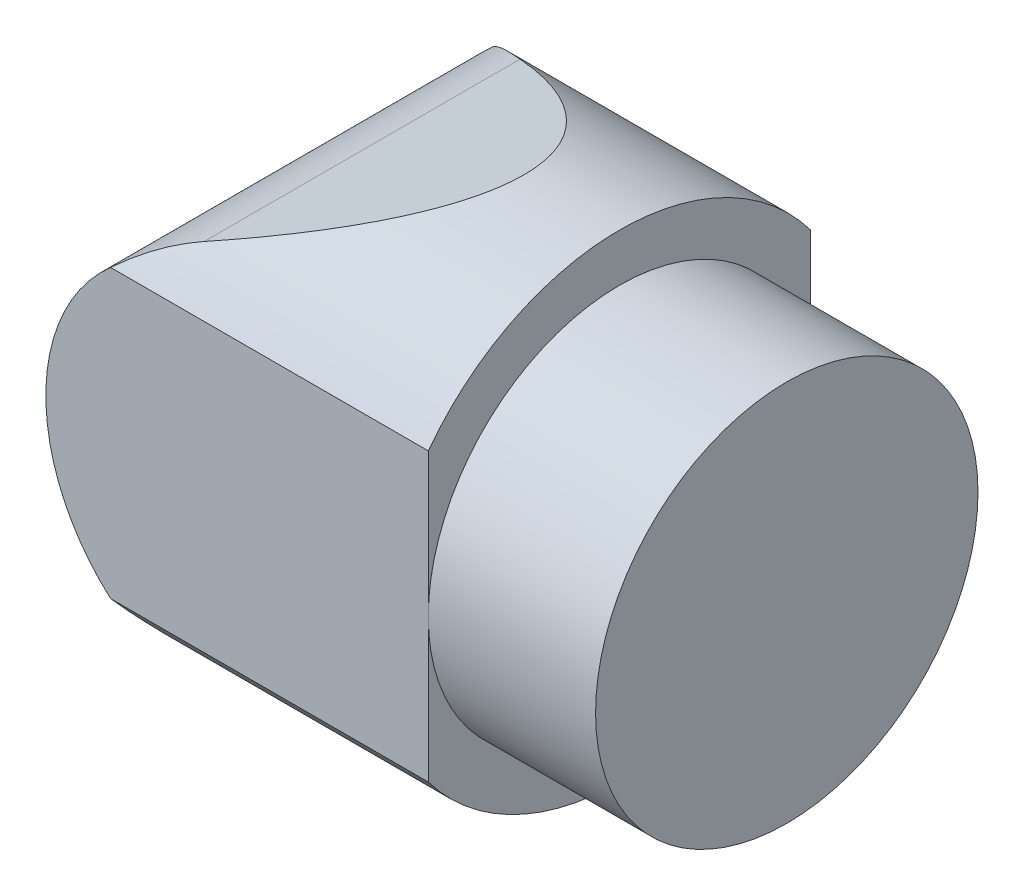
ISO-10303-21;
HEADER;
FILE_DESCRIPTION(('STEP AP214'),'2;1');
FILE_NAME('part.step','',(''),(''),'','','');
FILE_SCHEMA(('AUTOMOTIVE_DESIGN { 1 0 10303 214 1 1 1 1 }'));
ENDSEC;
DATA;
#1=APPLICATION_CONTEXT('core data for automotive mechanical design processes');
#2=APPLICATION_PROTOCOL_DEFINITION('international standard','automotive_design',2000,#1);
#3=PRODUCT_CONTEXT('',#1,'mechanical');
#4=PRODUCT('Part','Part','',(#3));
#5=PRODUCT_RELATED_PRODUCT_CATEGORY('part','',(#4));
#6=PRODUCT_DEFINITION_FORMATION('','',#4);
#7=PRODUCT_DEFINITION_CONTEXT('part definition',#1,'design');
#8=PRODUCT_DEFINITION('design','',#6,#7);
#9=PRODUCT_DEFINITION_SHAPE('','',#8);
#10=(LENGTH_UNIT() NAMED_UNIT(*) SI_UNIT(.MILLI.,.METRE.));
#11=(NAMED_UNIT(*) PLANE_ANGLE_UNIT() SI_UNIT($,.RADIAN.));
#12=(NAMED_UNIT(*) SI_UNIT($,.STERADIAN.) SOLID_ANGLE_UNIT());
#13=UNCERTAINTY_MEASURE_WITH_UNIT(LENGTH_MEASURE(1.E-05),#10,'distance_accuracy_value','');
#14=(GEOMETRIC_REPRESENTATION_CONTEXT(3) GLOBAL_UNCERTAINTY_ASSIGNED_CONTEXT((#13)) GLOBAL_UNIT_ASSIGNED_CONTEXT((#10,
#11,#12)) REPRESENTATION_CONTEXT('',''));
#15=CARTESIAN_POINT('',(0.,0.,0.));
#16=DIRECTION('',(0.,0.,1.));
#17=DIRECTION('',(1.,0.,0.));
#18=AXIS2_PLACEMENT_3D('',#15,#16,#17);
#19=CARTESIAN_POINT('',(0.,0.,-110.141421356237));
#20=DIRECTION('',(1.,0.,0.));
#21=DIRECTION('',(0.,0.,-1.));
#22=AXIS2_PLACEMENT_3D('',#19,#20,#21);
#23=PLANE('',#22);
#24=DIRECTION('',(0.,-1.,0.));
#25=VECTOR('',#24,1.);
#26=CARTESIAN_POINT('',(0.,30.,-40.));
#27=LINE('',#26,#25);
#28=CARTESIAN_POINT('',(0.,30.,-40.));
#29=VERTEX_POINT('',#28);
#30=CARTESIAN_POINT('',(0.,0.,-40.));
#31=VERTEX_POINT('',#30);
#32=EDGE_CURVE('E92',#29,#31,#27,.T.);
#33=ORIENTED_EDGE('',*,*,#32,.F.);
#34=CARTESIAN_POINT('',(0.,0.,0.));
#35=DIRECTION('',(1.,0.,0.));
#36=DIRECTION('',(0.,0.,-1.));
#37=AXIS2_PLACEMENT_3D('',#34,#35,#36);
#38=CIRCLE('',#37,50.);
#39=CARTESIAN_POINT('',(0.,30.,40.));
#40=VERTEX_POINT('',#39);
#41=EDGE_CURVE('E102',#29,#40,#38,.T.);
#42=ORIENTED_EDGE('',*,*,#41,.T.);
#43=DIRECTION('',(0.,1.,0.));
#44=VECTOR('',#43,1.);
#45=CARTESIAN_POINT('',(0.,30.,40.));
#46=LINE('',#45,#44);
#47=CARTESIAN_POINT('',(0.,0.,40.));
#48=VERTEX_POINT('',#47);
#49=EDGE_CURVE('E154',#48,#40,#46,.T.);
#50=ORIENTED_EDGE('',*,*,#49,.F.);
#51=CARTESIAN_POINT('',(0.,0.,0.));
#52=DIRECTION('',(1.,0.,0.));
#53=DIRECTION('',(0.,0.,-1.));
#54=AXIS2_PLACEMENT_3D('',#51,#52,#53);
#55=CIRCLE('',#54,40.);
#56=EDGE_CURVE('E104',#31,#48,#55,.T.);
#57=ORIENTED_EDGE('',*,*,#56,.F.);
#58=EDGE_LOOP('',(#33,#42,#50,#57));
#59=FACE_BOUND('',#58,.T.);
#60=ADVANCED_FACE('F31',(#59),#23,.T.);
#61=CARTESIAN_POINT('',(-100.,0.,0.));
#62=DIRECTION('',(1.,0.,0.));
#63=DIRECTION('',(0.,0.,-1.));
#64=AXIS2_PLACEMENT_3D('',#61,#62,#63);
#65=CYLINDRICAL_SURFACE('',#64,50.);
#66=DIRECTION('',(1.,0.,0.));
#67=VECTOR('',#66,1.);
#68=CARTESIAN_POINT('',(-80.,-30.,-40.));
#69=LINE('',#68,#67);
#70=CARTESIAN_POINT('',(-66.4575131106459,-30.,-40.));
#71=VERTEX_POINT('',#70);
#72=CARTESIAN_POINT('',(0.,-30.,-40.));
#73=VERTEX_POINT('',#72);
#74=EDGE_CURVE('E47',#71,#73,#69,.T.);
#75=ORIENTED_EDGE('',*,*,#74,.T.);
#76=CARTESIAN_POINT('',(0.,-30.,40.));
#77=VERTEX_POINT('',#76);
#78=EDGE_CURVE('E112',#77,#73,#38,.T.);
#79=ORIENTED_EDGE('',*,*,#78,.F.);
#80=DIRECTION('',(1.,0.,0.));
#81=VECTOR('',#80,1.);
#82=CARTESIAN_POINT('',(-80.,-30.,40.));
#83=LINE('',#82,#81);
#84=CARTESIAN_POINT('',(-66.4575131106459,-30.,40.));
#85=VERTEX_POINT('',#84);
#86=EDGE_CURVE('E156',#85,#77,#83,.T.);
#87=ORIENTED_EDGE('',*,*,#86,.F.);
#88=CARTESIAN_POINT('',(-53.8313881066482,-37.5325552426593,33.0349405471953));
#89=CARTESIAN_POINT('',(-54.4122214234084,-37.3184792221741,33.2781937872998));
#90=CARTESIAN_POINT('',(-54.9846616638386,-37.0922393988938,33.5304396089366));
#91=CARTESIAN_POINT('',(-56.1127283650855,-36.6163241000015,34.04949578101));
#92=CARTESIAN_POINT('',(-56.6683600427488,-36.3666559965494,34.3163015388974));
#93=CARTESIAN_POINT('',(-57.7626277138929,-35.8448879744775,34.8609556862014));
#94=CARTESIAN_POINT('',(-58.301279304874,-35.5728095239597,35.1387933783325));
#95=CARTESIAN_POINT('',(-59.3623303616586,-35.0065961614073,35.702913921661));
#96=CARTESIAN_POINT('',(-59.8847283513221,-34.7124592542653,35.9891975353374));
#97=CARTESIAN_POINT('',(-61.4337549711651,-33.7941056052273,36.8601691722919));
#98=CARTESIAN_POINT('',(-62.4360387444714,-33.1369022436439,37.4538421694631));
#99=CARTESIAN_POINT('',(-64.3757445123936,-31.7372601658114,38.6470320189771));
#100=CARTESIAN_POINT('',(-65.3131471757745,-30.9947962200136,39.2465505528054));
#101=CARTESIAN_POINT('',(-67.1187591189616,-29.4278420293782,40.4347194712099));
#102=CARTESIAN_POINT('',(-67.9871454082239,-28.6035746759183,41.0233944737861));
#103=CARTESIAN_POINT('',(-69.6537549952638,-26.8718847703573,42.1780081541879));
#104=CARTESIAN_POINT('',(-70.4519805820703,-25.9644649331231,42.7439475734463));
#105=CARTESIAN_POINT('',(-71.5910002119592,-24.5433508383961,43.5651542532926));
#106=CARTESIAN_POINT('',(-71.9605622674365,-24.0602382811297,43.8339796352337));
#107=CARTESIAN_POINT('',(-72.6797932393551,-23.0738729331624,44.3611197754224));
#108=CARTESIAN_POINT('',(-73.0294634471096,-22.5706214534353,44.61943521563));
#109=CARTESIAN_POINT('',(-73.7077466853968,-21.5445095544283,45.1238387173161));
#110=CARTESIAN_POINT('',(-74.0363679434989,-21.0216569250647,45.3699315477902));
#111=CARTESIAN_POINT('',(-74.6716381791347,-19.9565067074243,45.8484334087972));
#112=CARTESIAN_POINT('',(-74.9782817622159,-19.4142043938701,46.0808390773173));
#113=CARTESIAN_POINT('',(-75.7076082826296,-18.0503399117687,46.6364022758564));
#114=CARTESIAN_POINT('',(-76.1167390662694,-17.2177933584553,46.9506128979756));
#115=CARTESIAN_POINT('',(-76.8803187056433,-15.5149052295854,47.5405001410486));
#116=CARTESIAN_POINT('',(-77.2347806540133,-14.6445727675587,47.816185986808));
#117=CARTESIAN_POINT('',(-77.7222008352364,-13.313858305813,48.1970353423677));
#118=CARTESIAN_POINT('',(-77.8772876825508,-12.8661110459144,48.3185324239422));
#119=CARTESIAN_POINT('',(-78.1722064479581,-11.9627923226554,48.5500670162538));
#120=CARTESIAN_POINT('',(-78.3120409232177,-11.5072221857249,48.660106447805));
#121=CARTESIAN_POINT('',(-78.7079443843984,-10.1295403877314,48.9722212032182));
#122=CARTESIAN_POINT('',(-78.9404509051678,-9.19635533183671,49.1563223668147));
#123=CARTESIAN_POINT('',(-79.3399731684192,-7.30137920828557,49.4734134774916));
#124=CARTESIAN_POINT('',(-79.5065739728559,-6.3394466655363,49.6060794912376));
#125=CARTESIAN_POINT('',(-79.7693132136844,-4.39990670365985,49.8155795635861));
#126=CARTESIAN_POINT('',(-79.8654517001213,-3.42229929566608,49.8924136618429));
#127=CARTESIAN_POINT('',(-79.9854249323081,-1.46006707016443,49.9883277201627));
#128=CARTESIAN_POINT('',(-80.0092772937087,-0.475444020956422,50.007421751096));
#129=CARTESIAN_POINT('',(-79.9842607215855,1.49224086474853,49.9874087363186));
#130=CARTESIAN_POINT('',(-79.9353970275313,2.47530280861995,49.9483058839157));
#131=CARTESIAN_POINT('',(-79.774156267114,4.33616655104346,49.8194887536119));
#132=CARTESIAN_POINT('',(-79.6684049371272,5.2149228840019,49.7350558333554));
#133=CARTESIAN_POINT('',(-79.400033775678,6.95808001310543,49.5212689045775));
#134=CARTESIAN_POINT('',(-79.2374183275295,7.82248191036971,49.3919183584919));
#135=CARTESIAN_POINT('',(-78.8576166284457,9.5316390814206,49.0907424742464));
#136=CARTESIAN_POINT('',(-78.6404284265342,10.3763936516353,48.9189156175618));
#137=CARTESIAN_POINT('',(-78.1542934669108,12.0416947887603,48.535839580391));
#138=CARTESIAN_POINT('',(-77.8853440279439,12.8622400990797,48.3245883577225));
#139=CARTESIAN_POINT('',(-77.2864594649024,14.5093010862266,47.8564907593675));
#140=CARTESIAN_POINT('',(-76.9544348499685,15.3346159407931,47.5981002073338));
#141=CARTESIAN_POINT('',(-76.241200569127,16.9515878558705,47.0465036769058));
#142=CARTESIAN_POINT('',(-75.8599901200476,17.7432443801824,46.7532971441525));
#143=CARTESIAN_POINT('',(-75.0518031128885,19.2907613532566,46.1363277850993));
#144=CARTESIAN_POINT('',(-74.6248102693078,20.0466089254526,45.8125540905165));
#145=CARTESIAN_POINT('',(-73.7283898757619,21.520686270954,45.1388613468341));
#146=CARTESIAN_POINT('',(-73.2589564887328,22.2389108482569,44.7889387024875));
#147=CARTESIAN_POINT('',(-72.4812671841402,23.3499599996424,44.2153230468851));
#148=CARTESIAN_POINT('',(-72.185813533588,23.7554964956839,43.9986786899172));
#149=CARTESIAN_POINT('',(-71.5817837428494,24.5528209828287,43.5587679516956));
#150=CARTESIAN_POINT('',(-71.2732101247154,24.9446115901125,43.3355028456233));
#151=CARTESIAN_POINT('',(-70.3283731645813,26.0994124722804,42.6569775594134));
#152=CARTESIAN_POINT('',(-69.6730041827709,26.8418368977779,42.1929951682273));
#153=CARTESIAN_POINT('',(-68.3144852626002,28.2712383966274,41.2488943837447));
#154=CARTESIAN_POINT('',(-67.611309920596,28.9581855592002,40.7687674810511));
#155=CARTESIAN_POINT('',(-66.1596380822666,30.2759697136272,39.7999289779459));
#156=CARTESIAN_POINT('',(-65.4111380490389,30.906802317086,39.311216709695));
#157=CARTESIAN_POINT('',(-63.8352911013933,32.1391428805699,38.3110096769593));
#158=CARTESIAN_POINT('',(-63.005907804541,32.7380231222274,37.7994869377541));
#159=CARTESIAN_POINT('',(-61.2997344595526,33.872862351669,36.785966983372));
#160=CARTESIAN_POINT('',(-60.422954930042,34.4088352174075,36.2839676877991));
#161=CARTESIAN_POINT('',(-59.0725179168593,35.1639661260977,35.5474227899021));
#162=CARTESIAN_POINT('',(-58.6167175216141,35.4074350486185,35.3047607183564));
#163=CARTESIAN_POINT('',(-57.6930537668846,35.8779106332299,34.826541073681));
#164=CARTESIAN_POINT('',(-57.2251911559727,36.104918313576,34.5909830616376));
#165=CARTESIAN_POINT('',(-56.276908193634,36.5422381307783,34.1286695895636));
#166=CARTESIAN_POINT('',(-55.796478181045,36.7525368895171,33.9019212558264));
#167=CARTESIAN_POINT('',(-54.8232258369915,37.1557422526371,33.4595386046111));
#168=CARTESIAN_POINT('',(-54.3304008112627,37.3486450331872,33.2439067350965));
#169=CARTESIAN_POINT('',(-53.8313881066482,37.5325552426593,33.0349405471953));
#170=B_SPLINE_CURVE_WITH_KNOTS('',3,(#88,#89,#90,#91,#92,#93,#94,#95,#96,#97,#98,#99,#100,#101,
#102,#103,#104,#105,#106,#107,#108,#109,#110,#111,#112,#113,#114,#115,#116,#117,#118,#119,#120,
#121,#122,#123,#124,#125,#126,#127,#128,#129,#130,#131,#132,#133,#134,#135,#136,#137,#138,#139,
#140,#141,#142,#143,#144,#145,#146,#147,#148,#149,#150,#151,#152,#153,#154,#155,#156,#157,#158,
#159,#160,#161,#162,#163,#164,#165,#166,#167,#168,#169),.UNSPECIFIED.,.F.,.F.,(4,2,2,2,2,2,2,2,
2,2,2,2,2,2,2,2,2,2,2,2,2,2,2,2,2,2,2,2,2,2,2,2,2,2,2,2,2,2,2,2,4),(0.,1.99491349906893,
3.98920135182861,5.98160050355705,7.97418007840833,11.9818640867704,15.9907370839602,
19.9889722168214,23.9870768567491,25.9815500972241,27.9758937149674,29.9694529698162,
31.9634998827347,34.8988225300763,37.83344110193,39.3005792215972,40.7674709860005,
43.7009178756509,46.6525503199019,49.6041806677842,52.5550916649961,55.5057900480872,
58.1700612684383,60.8341271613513,63.4982883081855,66.1625874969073,68.9389621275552,
71.7153809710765,74.4927907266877,77.2705830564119,78.9098123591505,80.5487279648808,
83.826618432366,87.106264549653,90.3861669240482,93.8148303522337,97.2427359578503,
98.9550746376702,100.667307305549,102.380897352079,104.094863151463),.UNSPECIFIED.);
#171=CARTESIAN_POINT('',(-53.8313881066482,-37.5325552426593,33.0349405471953));
#172=VERTEX_POINT('',#171);
#173=EDGE_CURVE('E122',#172,#85,#170,.T.);
#174=ORIENTED_EDGE('',*,*,#173,.F.);
#175=CARTESIAN_POINT('',(-155.678917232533,0.,0.));
#176=DIRECTION('',(0.345784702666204,0.938313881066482,0.));
#177=DIRECTION('',(0.938313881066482,-0.345784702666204,0.));
#178=AXIS2_PLACEMENT_3D('',#175,#176,#177);
#179=ELLIPSE('',#178,144.598646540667,50.);
#180=CARTESIAN_POINT('',(-53.8313881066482,-37.5325552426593,-33.0349405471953));
#181=VERTEX_POINT('',#180);
#182=EDGE_CURVE('E146',#181,#172,#179,.F.);
#183=ORIENTED_EDGE('',*,*,#182,.F.);
#184=CARTESIAN_POINT('',(-53.8313881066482,37.5325552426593,-33.0349405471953));
#185=CARTESIAN_POINT('',(-54.4122214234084,37.3184792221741,-33.2781937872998));
#186=CARTESIAN_POINT('',(-54.9846616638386,37.0922393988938,-33.5304396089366));
#187=CARTESIAN_POINT('',(-56.1127283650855,36.6163241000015,-34.04949578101));
#188=CARTESIAN_POINT('',(-56.6683600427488,36.3666559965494,-34.3163015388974));
#189=CARTESIAN_POINT('',(-57.7626277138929,35.8448879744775,-34.8609556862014));
#190=CARTESIAN_POINT('',(-58.301279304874,35.5728095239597,-35.1387933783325));
#191=CARTESIAN_POINT('',(-59.3623303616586,35.0065961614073,-35.702913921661));
#192=CARTESIAN_POINT('',(-59.8847283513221,34.7124592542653,-35.9891975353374));
#193=CARTESIAN_POINT('',(-61.4337549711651,33.7941056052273,-36.8601691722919));
#194=CARTESIAN_POINT('',(-62.4360387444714,33.1369022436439,-37.4538421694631));
#195=CARTESIAN_POINT('',(-64.3757445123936,31.7372601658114,-38.6470320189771));
#196=CARTESIAN_POINT('',(-65.3131471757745,30.9947962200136,-39.2465505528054));
#197=CARTESIAN_POINT('',(-67.1187591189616,29.4278420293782,-40.4347194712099));
#198=CARTESIAN_POINT('',(-67.9871454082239,28.6035746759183,-41.0233944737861));
#199=CARTESIAN_POINT('',(-69.6537549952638,26.8718847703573,-42.1780081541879));
#200=CARTESIAN_POINT('',(-70.4519805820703,25.9644649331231,-42.7439475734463));
#201=CARTESIAN_POINT('',(-71.5910002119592,24.5433508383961,-43.5651542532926));
#202=CARTESIAN_POINT('',(-71.9605622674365,24.0602382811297,-43.8339796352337));
#203=CARTESIAN_POINT('',(-72.6797932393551,23.0738729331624,-44.3611197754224));
#204=CARTESIAN_POINT('',(-73.0294634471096,22.5706214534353,-44.61943521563));
#205=CARTESIAN_POINT('',(-73.7077466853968,21.5445095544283,-45.1238387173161));
#206=CARTESIAN_POINT('',(-74.0363679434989,21.0216569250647,-45.3699315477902));
#207=CARTESIAN_POINT('',(-74.6716381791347,19.9565067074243,-45.8484334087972));
#208=CARTESIAN_POINT('',(-74.9782817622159,19.4142043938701,-46.0808390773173));
#209=CARTESIAN_POINT('',(-75.7076082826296,18.0503399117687,-46.6364022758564));
#210=CARTESIAN_POINT('',(-76.1167390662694,17.2177933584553,-46.9506128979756));
#211=CARTESIAN_POINT('',(-76.8803187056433,15.5149052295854,-47.5405001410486));
#212=CARTESIAN_POINT('',(-77.2347806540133,14.6445727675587,-47.816185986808));
#213=CARTESIAN_POINT('',(-77.7222008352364,13.313858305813,-48.1970353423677));
#214=CARTESIAN_POINT('',(-77.8772876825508,12.8661110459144,-48.3185324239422));
#215=CARTESIAN_POINT('',(-78.1722064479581,11.9627923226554,-48.5500670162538));
#216=CARTESIAN_POINT('',(-78.3120409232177,11.5072221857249,-48.660106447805));
#217=CARTESIAN_POINT('',(-78.7079443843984,10.1295403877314,-48.9722212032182));
#218=CARTESIAN_POINT('',(-78.9404509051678,9.19635533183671,-49.1563223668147));
#219=CARTESIAN_POINT('',(-79.3399731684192,7.30137920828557,-49.4734134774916));
#220=CARTESIAN_POINT('',(-79.5065739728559,6.3394466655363,-49.6060794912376));
#221=CARTESIAN_POINT('',(-79.7693132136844,4.39990670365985,-49.8155795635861));
#222=CARTESIAN_POINT('',(-79.8654517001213,3.42229929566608,-49.8924136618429));
#223=CARTESIAN_POINT('',(-79.9854249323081,1.46006707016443,-49.9883277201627));
#224=CARTESIAN_POINT('',(-80.0092772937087,0.475444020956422,-50.007421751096));
#225=CARTESIAN_POINT('',(-79.9842607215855,-1.49224086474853,-49.9874087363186));
#226=CARTESIAN_POINT('',(-79.9353970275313,-2.47530280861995,-49.9483058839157));
#227=CARTESIAN_POINT('',(-79.774156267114,-4.33616655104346,-49.8194887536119));
#228=CARTESIAN_POINT('',(-79.6684049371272,-5.2149228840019,-49.7350558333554));
#229=CARTESIAN_POINT('',(-79.400033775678,-6.95808001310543,-49.5212689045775));
#230=CARTESIAN_POINT('',(-79.2374183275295,-7.82248191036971,-49.3919183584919));
#231=CARTESIAN_POINT('',(-78.8576166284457,-9.5316390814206,-49.0907424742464));
#232=CARTESIAN_POINT('',(-78.6404284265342,-10.3763936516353,-48.9189156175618));
#233=CARTESIAN_POINT('',(-78.1542934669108,-12.0416947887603,-48.535839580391));
#234=CARTESIAN_POINT('',(-77.8853440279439,-12.8622400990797,-48.3245883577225));
#235=CARTESIAN_POINT('',(-77.2864594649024,-14.5093010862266,-47.8564907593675));
#236=CARTESIAN_POINT('',(-76.9544348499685,-15.3346159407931,-47.5981002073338));
#237=CARTESIAN_POINT('',(-76.241200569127,-16.9515878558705,-47.0465036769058));
#238=CARTESIAN_POINT('',(-75.8599901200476,-17.7432443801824,-46.7532971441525));
#239=CARTESIAN_POINT('',(-75.0518031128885,-19.2907613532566,-46.1363277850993));
#240=CARTESIAN_POINT('',(-74.6248102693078,-20.0466089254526,-45.8125540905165));
#241=CARTESIAN_POINT('',(-73.7283898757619,-21.520686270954,-45.1388613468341));
#242=CARTESIAN_POINT('',(-73.2589564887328,-22.2389108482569,-44.7889387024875));
#243=CARTESIAN_POINT('',(-72.4812671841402,-23.3499599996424,-44.2153230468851));
#244=CARTESIAN_POINT('',(-72.185813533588,-23.7554964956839,-43.9986786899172));
#245=CARTESIAN_POINT('',(-71.5817837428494,-24.5528209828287,-43.5587679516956));
#246=CARTESIAN_POINT('',(-71.2732101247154,-24.9446115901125,-43.3355028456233));
#247=CARTESIAN_POINT('',(-70.3283731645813,-26.0994124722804,-42.6569775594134));
#248=CARTESIAN_POINT('',(-69.6730041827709,-26.8418368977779,-42.1929951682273));
#249=CARTESIAN_POINT('',(-68.3144852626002,-28.2712383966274,-41.2488943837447));
#250=CARTESIAN_POINT('',(-67.611309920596,-28.9581855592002,-40.7687674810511));
#251=CARTESIAN_POINT('',(-66.1596380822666,-30.2759697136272,-39.7999289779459));
#252=CARTESIAN_POINT('',(-65.4111380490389,-30.906802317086,-39.311216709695));
#253=CARTESIAN_POINT('',(-63.8352911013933,-32.1391428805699,-38.3110096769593));
#254=CARTESIAN_POINT('',(-63.005907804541,-32.7380231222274,-37.7994869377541));
#255=CARTESIAN_POINT('',(-61.2997344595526,-33.872862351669,-36.785966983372));
#256=CARTESIAN_POINT('',(-60.422954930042,-34.4088352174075,-36.2839676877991));
#257=CARTESIAN_POINT('',(-59.0725179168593,-35.1639661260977,-35.5474227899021));
#258=CARTESIAN_POINT('',(-58.6167175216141,-35.4074350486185,-35.3047607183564));
#259=CARTESIAN_POINT('',(-57.6930537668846,-35.8779106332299,-34.826541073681));
#260=CARTESIAN_POINT('',(-57.2251911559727,-36.104918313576,-34.5909830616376));
#261=CARTESIAN_POINT('',(-56.276908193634,-36.5422381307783,-34.1286695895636));
#262=CARTESIAN_POINT('',(-55.796478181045,-36.7525368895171,-33.9019212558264));
#263=CARTESIAN_POINT('',(-54.8232258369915,-37.1557422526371,-33.4595386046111));
#264=CARTESIAN_POINT('',(-54.3304008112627,-37.3486450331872,-33.2439067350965));
#265=CARTESIAN_POINT('',(-53.8313881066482,-37.5325552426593,-33.0349405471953));
#266=B_SPLINE_CURVE_WITH_KNOTS('',3,(#184,#185,#186,#187,#188,#189,#190,#191,#192,#193,#194,
#195,#196,#197,#198,#199,#200,#201,#202,#203,#204,#205,#206,#207,#208,#209,#210,#211,#212,#213,
#214,#215,#216,#217,#218,#219,#220,#221,#222,#223,#224,#225,#226,#227,#228,#229,#230,#231,#232,
#233,#234,#235,#236,#237,#238,#239,#240,#241,#242,#243,#244,#245,#246,#247,#248,#249,#250,#251,
#252,#253,#254,#255,#256,#257,#258,#259,#260,#261,#262,#263,#264,#265),.UNSPECIFIED.,.F.,.F.,(4,
2,2,2,2,2,2,2,2,2,2,2,2,2,2,2,2,2,2,2,2,2,2,2,2,2,2,2,2,2,2,2,2,2,2,2,2,2,2,2,4),(0.,
1.99491349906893,3.98920135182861,5.98160050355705,7.97418007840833,11.9818640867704,
15.9907370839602,19.9889722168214,23.9870768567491,25.9815500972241,27.9758937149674,
29.9694529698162,31.9634998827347,34.8988225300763,37.83344110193,39.3005792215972,
40.7674709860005,43.7009178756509,46.6525503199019,49.6041806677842,52.5550916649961,
55.5057900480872,58.1700612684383,60.8341271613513,63.4982883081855,66.1625874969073,
68.9389621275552,71.7153809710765,74.4927907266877,77.2705830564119,78.9098123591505,
80.5487279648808,83.826618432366,87.106264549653,90.3861669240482,93.8148303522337,
97.2427359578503,98.9550746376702,100.667307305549,102.380897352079,104.094863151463),.UNSPECIFIED.);
#267=EDGE_CURVE('E53',#71,#181,#266,.T.);
#268=ORIENTED_EDGE('',*,*,#267,.F.);
#269=EDGE_LOOP('',(#75,#79,#87,#174,#183,#268));
#270=FACE_BOUND('',#269,.T.);
#271=ADVANCED_FACE('F169',(#270),#65,.T.);
#272=EDGE_CURVE('E106',#31,#73,#27,.T.);
#273=ORIENTED_EDGE('',*,*,#272,.F.);
#274=EDGE_CURVE('E118',#48,#31,#55,.T.);
#275=ORIENTED_EDGE('',*,*,#274,.F.);
#276=EDGE_CURVE('E164',#77,#48,#46,.T.);
#277=ORIENTED_EDGE('',*,*,#276,.F.);
#278=ORIENTED_EDGE('',*,*,#78,.T.);
#279=EDGE_LOOP('',(#273,#275,#277,#278));
#280=FACE_BOUND('',#279,.T.);
#281=ADVANCED_FACE('F173',(#280),#23,.T.);
#282=DIRECTION('',(1.,0.,0.));
#283=VECTOR('',#282,1.);
#284=CARTESIAN_POINT('',(-80.,30.,-40.));
#285=LINE('',#284,#283);
#286=CARTESIAN_POINT('',(-66.4575131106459,30.,-40.));
#287=VERTEX_POINT('',#286);
#288=EDGE_CURVE('E89',#287,#29,#285,.T.);
#289=ORIENTED_EDGE('',*,*,#288,.F.);
#290=CARTESIAN_POINT('',(-53.8313881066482,37.5325552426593,-33.0349405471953));
#291=VERTEX_POINT('',#290);
#292=EDGE_CURVE('E141',#291,#287,#266,.T.);
#293=ORIENTED_EDGE('',*,*,#292,.F.);
#294=CARTESIAN_POINT('',(-155.678917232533,0.,0.));
#295=DIRECTION('',(0.345784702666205,-0.938313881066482,0.));
#296=DIRECTION('',(0.938313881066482,0.345784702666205,0.));
#297=AXIS2_PLACEMENT_3D('',#294,#295,#296);
#298=ELLIPSE('',#297,144.598646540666,50.);
#299=CARTESIAN_POINT('',(-53.8313881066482,37.5325552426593,33.0349405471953));
#300=VERTEX_POINT('',#299);
#301=EDGE_CURVE('E129',#300,#291,#298,.F.);
#302=ORIENTED_EDGE('',*,*,#301,.F.);
#303=CARTESIAN_POINT('',(-66.4575131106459,30.,40.));
#304=VERTEX_POINT('',#303);
#305=EDGE_CURVE('E116',#304,#300,#170,.T.);
#306=ORIENTED_EDGE('',*,*,#305,.F.);
#307=DIRECTION('',(1.,0.,0.));
#308=VECTOR('',#307,1.);
#309=CARTESIAN_POINT('',(-80.,30.,40.));
#310=LINE('',#309,#308);
#311=EDGE_CURVE('E111',#304,#40,#310,.T.);
#312=ORIENTED_EDGE('',*,*,#311,.T.);
#313=ORIENTED_EDGE('',*,*,#41,.F.);
#314=EDGE_LOOP('',(#289,#293,#302,#306,#312,#313));
#315=FACE_BOUND('',#314,.T.);
#316=ADVANCED_FACE('F33',(#315),#65,.T.);
#317=CARTESIAN_POINT('',(35.,0.,0.));
#318=DIRECTION('',(-1.,0.,0.));
#319=DIRECTION('',(0.,0.,1.));
#320=AXIS2_PLACEMENT_3D('',#317,#318,#319);
#321=CYLINDRICAL_SURFACE('',#320,40.);
#322=CARTESIAN_POINT('',(35.,0.,0.));
#323=DIRECTION('',(1.,0.,0.));
#324=DIRECTION('',(0.,0.,-1.));
#325=AXIS2_PLACEMENT_3D('',#322,#323,#324);
#326=CIRCLE('',#325,40.);
#327=CARTESIAN_POINT('',(35.,0.,-40.));
#328=VERTEX_POINT('',#327);
#329=EDGE_CURVE('E113',#328,#328,#326,.T.);
#330=ORIENTED_EDGE('',*,*,#329,.F.);
#331=EDGE_LOOP('',(#330));
#332=FACE_BOUND('',#331,.T.);
#333=ORIENTED_EDGE('',*,*,#274,.T.);
#334=ORIENTED_EDGE('',*,*,#56,.T.);
#335=EDGE_LOOP('',(#333,#334));
#336=FACE_BOUND('',#335,.T.);
#337=ADVANCED_FACE('F189',(#332,#336),#321,.T.);
#338=CARTESIAN_POINT('',(35.,0.,-110.141421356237));
#339=DIRECTION('',(1.,0.,0.));
#340=DIRECTION('',(0.,0.,-1.));
#341=AXIS2_PLACEMENT_3D('',#338,#339,#340);
#342=PLANE('',#341);
#343=ORIENTED_EDGE('',*,*,#329,.T.);
#344=EDGE_LOOP('',(#343));
#345=FACE_BOUND('',#344,.T.);
#346=ADVANCED_FACE('F193',(#345),#342,.T.);
#347=CARTESIAN_POINT('',(-20.,50.,-50.));
#348=DIRECTION('',(0.345784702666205,-0.938313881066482,0.));
#349=DIRECTION('',(0.938313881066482,0.345784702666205,0.));
#350=AXIS2_PLACEMENT_3D('',#347,#348,#349);
#351=PLANE('',#350);
#352=ORIENTED_EDGE('',*,*,#301,.T.);
#353=DIRECTION('',(0.,0.,1.));
#354=VECTOR('',#353,1.);
#355=CARTESIAN_POINT('',(-53.8313881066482,37.5325552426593,-50.));
#356=LINE('',#355,#354);
#357=EDGE_CURVE('E160',#291,#300,#356,.T.);
#358=ORIENTED_EDGE('',*,*,#357,.T.);
#359=EDGE_LOOP('',(#352,#358));
#360=FACE_BOUND('',#359,.T.);
#361=ADVANCED_FACE('F137',(#360),#351,.F.);
#362=CARTESIAN_POINT('',(-40.,0.,-50.));
#363=DIRECTION('',(0.,0.,1.));
#364=DIRECTION('',(1.,0.,0.));
#365=AXIS2_PLACEMENT_3D('',#362,#363,#364);
#366=CYLINDRICAL_SURFACE('',#365,40.);
#367=ORIENTED_EDGE('',*,*,#292,.T.);
#368=CARTESIAN_POINT('',(-40.,0.,-40.));
#369=DIRECTION('',(0.,0.,1.));
#370=DIRECTION('',(1.,0.,0.));
#371=AXIS2_PLACEMENT_3D('',#368,#369,#370);
#372=CIRCLE('',#371,40.);
#373=EDGE_CURVE('E11',#287,#71,#372,.T.);
#374=ORIENTED_EDGE('',*,*,#373,.T.);
#375=ORIENTED_EDGE('',*,*,#267,.T.);
#376=DIRECTION('',(0.,0.,1.));
#377=VECTOR('',#376,1.);
#378=CARTESIAN_POINT('',(-53.8313881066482,-37.5325552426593,-50.));
#379=LINE('',#378,#377);
#380=EDGE_CURVE('E155',#181,#172,#379,.T.);
#381=ORIENTED_EDGE('',*,*,#380,.T.);
#382=ORIENTED_EDGE('',*,*,#173,.T.);
#383=CARTESIAN_POINT('',(-40.,0.,40.));
#384=DIRECTION('',(0.,0.,-1.));
#385=DIRECTION('',(-1.,0.,0.));
#386=AXIS2_PLACEMENT_3D('',#383,#384,#385);
#387=CIRCLE('',#386,40.);
#388=EDGE_CURVE('E40',#85,#304,#387,.T.);
#389=ORIENTED_EDGE('',*,*,#388,.T.);
#390=ORIENTED_EDGE('',*,*,#305,.T.);
#391=ORIENTED_EDGE('',*,*,#357,.F.);
#392=EDGE_LOOP('',(#367,#374,#375,#381,#382,#389,#390,#391));
#393=FACE_BOUND('',#392,.T.);
#394=ADVANCED_FACE('F131',(#393),#366,.T.);
#395=CARTESIAN_POINT('',(-53.8313881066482,-37.5325552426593,-50.));
#396=DIRECTION('',(0.345784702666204,0.938313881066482,0.));
#397=DIRECTION('',(-0.938313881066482,0.345784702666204,0.));
#398=AXIS2_PLACEMENT_3D('',#395,#396,#397);
#399=PLANE('',#398);
#400=ORIENTED_EDGE('',*,*,#182,.T.);
#401=ORIENTED_EDGE('',*,*,#380,.F.);
#402=EDGE_LOOP('',(#400,#401));
#403=FACE_BOUND('',#402,.T.);
#404=ADVANCED_FACE('F136',(#403),#399,.F.);
#405=CARTESIAN_POINT('',(-80.,30.,40.));
#406=DIRECTION('',(0.,0.,-1.));
#407=DIRECTION('',(-1.,0.,0.));
#408=AXIS2_PLACEMENT_3D('',#405,#406,#407);
#409=PLANE('',#408);
#410=ORIENTED_EDGE('',*,*,#388,.F.);
#411=ORIENTED_EDGE('',*,*,#86,.T.);
#412=ORIENTED_EDGE('',*,*,#276,.T.);
#413=ORIENTED_EDGE('',*,*,#49,.T.);
#414=ORIENTED_EDGE('',*,*,#311,.F.);
#415=EDGE_LOOP('',(#410,#411,#412,#413,#414));
#416=FACE_BOUND('',#415,.T.);
#417=ADVANCED_FACE('F152',(#416),#409,.F.);
#418=CARTESIAN_POINT('',(-80.,30.,-40.));
#419=DIRECTION('',(0.,0.,1.));
#420=DIRECTION('',(1.,0.,0.));
#421=AXIS2_PLACEMENT_3D('',#418,#419,#420);
#422=PLANE('',#421);
#423=ORIENTED_EDGE('',*,*,#288,.T.);
#424=ORIENTED_EDGE('',*,*,#32,.T.);
#425=ORIENTED_EDGE('',*,*,#272,.T.);
#426=ORIENTED_EDGE('',*,*,#74,.F.);
#427=ORIENTED_EDGE('',*,*,#373,.F.);
#428=EDGE_LOOP('',(#423,#424,#425,#426,#427));
#429=FACE_BOUND('',#428,.T.);
#430=ADVANCED_FACE('F91',(#429),#422,.F.);
#431=CLOSED_SHELL('',(#60,#271,#281,#316,#337,#346,#361,#394,#404,#417,#430));
#432=MANIFOLD_SOLID_BREP('B2',#431);
#433=ADVANCED_BREP_SHAPE_REPRESENTATION('',(#18,#432),#14);
#434=SHAPE_DEFINITION_REPRESENTATION(#9,#433);
ENDSEC;
END-ISO-10303-21;
